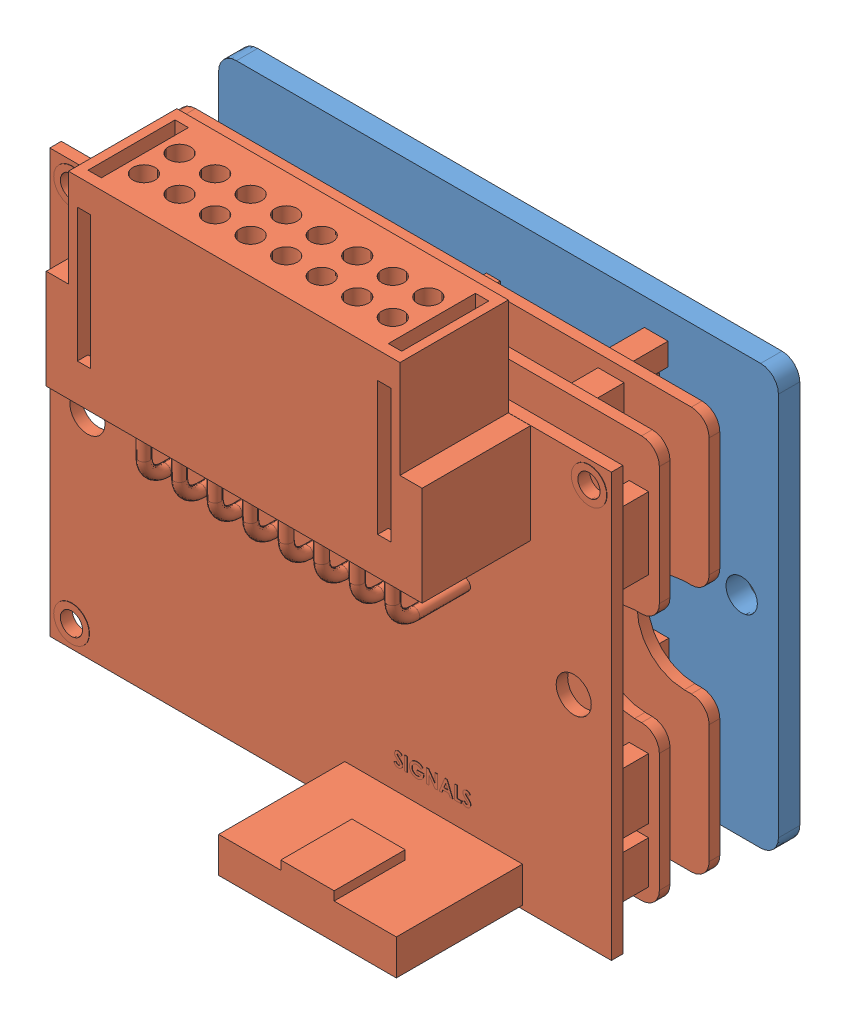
SolidWorks assembly ELMO Assm.SLDASM, configuration Default (file format 12000). Lengths in mm.
Overall size (80.26 74.4 45.21).
2 component instances, 2 part files, 3 mates.
Components (placement in the parent):
- ELMO PCB Base-1: ELMO PCB Base.SLDPRT [Default] at origin size (80.01 59.99 3.05)
- PWM board-1: PWM board.SLDPRT [Default] at (0.254 -0.4572 0) size (80.26 74.4 42.16)
Mates (geometry in assembly coordinates):
- Coincident2: coincident anti-aligned: plane of ELMO PCB Base-1 through (-37.465 27.4574 3.048) normal (0 0 1); plane of PWM board-1 through (40.259 35.97 3.048) normal (0 0 -1)
- Coincident3: coincident aligned: plane of ELMO PCB Base-1 through (-40.005 27.4574 3.048) normal (-1 0 0); plane of PWM board-1 through (-40.005 29.9974 27.178) normal (-1 0 0)
- Coincident4: coincident aligned: plane of ELMO PCB Base-1 through (-37.465 29.9974 3.048) normal (0 1 0); plane of PWM board-1 through (-40.005 29.9974 27.178) normal (0 1 0)
